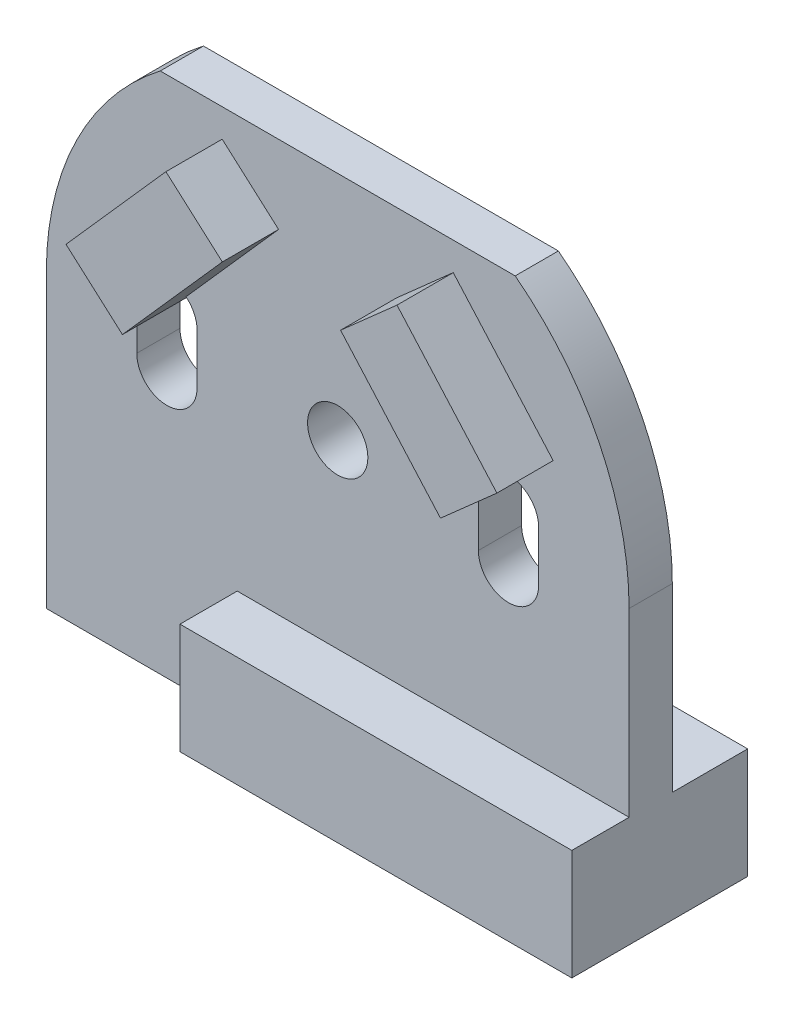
from build123d import *

# Parameters (mm, degrees)
SKETCH1_R                = 0.6
BOSS_EXTRUDE1_DEPTH      = 0.86
BOSS_EXTRUDE2_DEPTH      = 1.98
BOSS_EXTRUDE3_DEPTH      = 2
BOSS_EXTRUDE3_DEPTH_BACK = 1.5


with BuildPart() as part:
    # Sketch1 → Boss-Extrude1 (new body)
    # profile 1 of 8: a face of its own
    with BuildSketch(Plane.XY):
        with BuildLine():
            ThreePointArc((-3.532704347, 4.6), (-5.202388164, 2.564206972), (-5.8, 0))
            ThreePointArc((-5.8, 0), (-4.75604878, -3.319638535), (-2, -5.444263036))
            Line((-2, -5.444263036), (-2, -3.6))
            Line((-2, -3.6), (4.5475268, -3.6))
            ThreePointArc((4.5475268, -3.6), (5.477940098, -1.905825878), (5.8, 0))
            ThreePointArc((5.8, 0), (5.202388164, 2.564206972), (3.532704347, 4.6))
            Line((3.532704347, 4.6), (-3.532704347, 4.6))
        make_face()
        Circle(SKETCH1_R, mode=Mode.SUBTRACT)
        with BuildLine():
            ThreePointArc((-3.019719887, 0.964098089), (-2.857704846, 0.756741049), (-2.8, 0.5))
            Line((-2.8, 0.5), (-2.8, -0.5))
            ThreePointArc((-2.8, -0.5), (-3.4, -1.1), (-4, -0.5))
            Line((-4, -0.5), (-4, 0.5))
            ThreePointArc((-4, 0.5), (-3.857081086, 0.888686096), (-3.496410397, 1.092203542))
            Line((-3.496410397, 1.092203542), (-4.288680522, 1.793660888))
            Line((-4.288680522, 1.793660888), (-2.3, 4.039801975))
            Line((-2.3, 4.039801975), (-1.176929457, 3.045461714))
            Line((-1.176929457, 3.045461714), (-3.019719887, 0.964098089))
        make_face(mode=Mode.SUBTRACT)
        with BuildLine():
            ThreePointArc((3.496410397, 1.092203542), (3.857081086, 0.888686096), (4, 0.5))
            Line((4, 0.5), (4, -0.5))
            ThreePointArc((4, -0.5), (3.4, -1.1), (2.8, -0.5))
            Line((2.8, -0.5), (2.8, 0.5))
            ThreePointArc((2.8, 0.5), (2.857704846, 0.756741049), (3.019719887, 0.964098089))
            Line((3.019719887, 0.964098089), (1.176929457, 3.045461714))
            Line((1.176929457, 3.045461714), (2.3, 4.039801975))
            Line((2.3, 4.039801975), (4.288680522, 1.793660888))
            Line((4.288680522, 1.793660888), (3.496410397, 1.092203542))
        make_face(mode=Mode.SUBTRACT)
    # profile 2 of 8: a face of its own
    with BuildSketch(Plane.XY):
        with BuildLine():
            Line((-5.8, 0), (-5.8, -5.8))
            Line((-5.8, -5.8), (-2, -5.8))
            Line((-2, -5.8), (-2, -5.444263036))
            ThreePointArc((-2, -5.444263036), (-4.75604878, -3.319638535), (-5.8, 0))
        make_face()
    # profile 3 of 8: a face of its own
    with BuildSketch(Plane.XY):
        with BuildLine():
            ThreePointArc((-2, -5.444263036), (-1.015695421, -5.710373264), (8e-09, -5.8))
            ThreePointArc((8e-09, -5.8), (2.525866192, -5.221110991), (4.5475268, -3.6))
            Line((4.5475268, -3.6), (-2, -3.6))
            Line((-2, -3.6), (-2, -5.444263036))
        make_face()
    # profile 4 of 8: a face of its own
    with BuildSketch(Plane.XY):
        with BuildLine():
            Line((-2, -5.444263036), (-2, -5.8))
            Line((-2, -5.8), (8e-09, -5.8))
            ThreePointArc((8e-09, -5.8), (-1.015695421, -5.710373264), (-2, -5.444263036))
        make_face()
    # profile 5 of 8: a face of its own
    with BuildSketch(Plane.XY):
        with BuildLine():
            ThreePointArc((4.5475268, -3.6), (2.525866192, -5.221110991), (8e-09, -5.8))
            Line((8e-09, -5.8), (5.8, -5.8))
            Line((5.8, -5.8), (5.8, -3.6))
            Line((5.8, -3.6), (4.5475268, -3.6))
        make_face()
    # profile 6 of 8: a face of its own
    with BuildSketch(Plane.XY):
        with BuildLine():
            ThreePointArc((5.8, 0), (5.477940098, -1.905825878), (4.5475268, -3.6))
            Line((4.5475268, -3.6), (5.8, -3.6))
            Line((5.8, -3.6), (5.8, 0))
        make_face()
    # profile 7 of 8: a face of its own
    with BuildSketch(Plane.XY):
        with BuildLine():
            ThreePointArc((3.019719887, 0.964098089), (3.244281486, 1.079440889), (3.496410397, 1.092203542))
            Line((3.496410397, 1.092203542), (4.288680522, 1.793660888))
            Line((4.288680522, 1.793660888), (2.3, 4.039801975))
            Line((2.3, 4.039801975), (1.176929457, 3.045461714))
            Line((1.176929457, 3.045461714), (3.019719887, 0.964098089))
        make_face()
    # profile 8 of 8: a face of its own
    with BuildSketch(Plane.XY):
        with BuildLine():
            ThreePointArc((-3.496410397, 1.092203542), (-3.244281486, 1.079440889), (-3.019719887, 0.964098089))
            Line((-3.019719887, 0.964098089), (-1.176929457, 3.045461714))
            Line((-1.176929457, 3.045461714), (-2.3, 4.039801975))
            Line((-2.3, 4.039801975), (-4.288680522, 1.793660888))
            Line((-4.288680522, 1.793660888), (-3.496410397, 1.092203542))
        make_face()
    extrude(amount=BOSS_EXTRUDE1_DEPTH)

    # Sketch1_3 → Boss-Extrude2 (add)
    with BuildSketch(Plane.XY):
        Polygon((-2.3, 4.039801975), (-4.288680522, 1.793660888), (-3.165609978, 0.799320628), (-1.176929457, 3.045461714), align=None)
        Polygon((1.176929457, 3.045461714), (2.3, 4.039801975), (4.288680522, 1.793660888), (3.165609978, 0.799320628), align=None)
    extrude(amount=BOSS_EXTRUDE2_DEPTH)

    # Sketch1_4 → Boss-Extrude3 (add, two sides: drawn at the far end of the back side and taken through both)
    with BuildSketch(Plane.XY.offset(-BOSS_EXTRUDE3_DEPTH_BACK)):
        with BuildLine():
            ThreePointArc((-2, -5.444263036), (-1.015695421, -5.710373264), (8e-09, -5.8))
            ThreePointArc((8e-09, -5.8), (2.525866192, -5.221110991), (4.5475268, -3.6))
            Line((4.5475268, -3.6), (-2, -3.6))
            Line((-2, -3.6), (-2, -5.444263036))
        make_face()
        with BuildLine():
            ThreePointArc((4.5475268, -3.6), (2.525866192, -5.221110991), (8e-09, -5.8))
            Line((8e-09, -5.8), (5.8, -5.8))
            Line((5.8, -5.8), (5.8, -3.6))
            Line((5.8, -3.6), (4.5475268, -3.6))
        make_face()
        with BuildLine():
            Line((-2, -5.444263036), (-2, -5.8))
            Line((-2, -5.8), (8e-09, -5.8))
            ThreePointArc((8e-09, -5.8), (-1.015695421, -5.710373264), (-2, -5.444263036))
        make_face()
    extrude(amount=BOSS_EXTRUDE3_DEPTH + BOSS_EXTRUDE3_DEPTH_BACK)


solid = part.part
